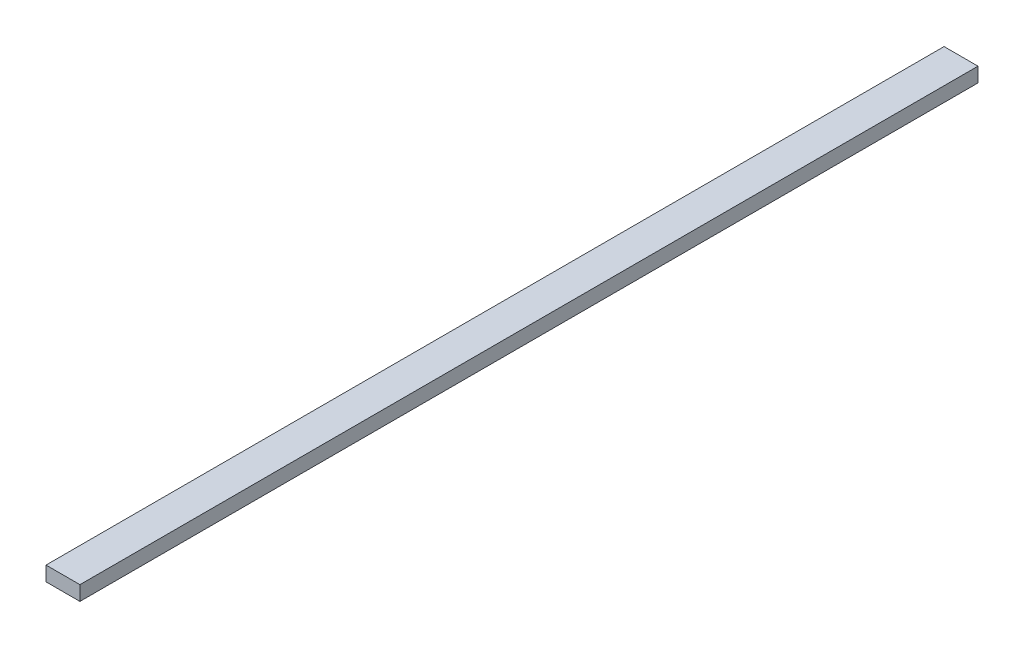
ISO-10303-21;
HEADER;
FILE_DESCRIPTION(('STEP AP214'),'2;1');
FILE_NAME('part.step','',(''),(''),'','','');
FILE_SCHEMA(('AUTOMOTIVE_DESIGN { 1 0 10303 214 1 1 1 1 }'));
ENDSEC;
DATA;
#1=APPLICATION_CONTEXT('core data for automotive mechanical design processes');
#2=APPLICATION_PROTOCOL_DEFINITION('international standard','automotive_design',2000,#1);
#3=PRODUCT_CONTEXT('',#1,'mechanical');
#4=PRODUCT('Part','Part','',(#3));
#5=PRODUCT_RELATED_PRODUCT_CATEGORY('part','',(#4));
#6=PRODUCT_DEFINITION_FORMATION('','',#4);
#7=PRODUCT_DEFINITION_CONTEXT('part definition',#1,'design');
#8=PRODUCT_DEFINITION('design','',#6,#7);
#9=PRODUCT_DEFINITION_SHAPE('','',#8);
#10=(LENGTH_UNIT() NAMED_UNIT(*) SI_UNIT(.MILLI.,.METRE.));
#11=(NAMED_UNIT(*) PLANE_ANGLE_UNIT() SI_UNIT($,.RADIAN.));
#12=(NAMED_UNIT(*) SI_UNIT($,.STERADIAN.) SOLID_ANGLE_UNIT());
#13=UNCERTAINTY_MEASURE_WITH_UNIT(LENGTH_MEASURE(1.E-05),#10,'distance_accuracy_value','');
#14=(GEOMETRIC_REPRESENTATION_CONTEXT(3) GLOBAL_UNCERTAINTY_ASSIGNED_CONTEXT((#13)) GLOBAL_UNIT_ASSIGNED_CONTEXT((#10,
#11,#12)) REPRESENTATION_CONTEXT('',''));
#15=CARTESIAN_POINT('',(0.,0.,0.));
#16=DIRECTION('',(0.,0.,1.));
#17=DIRECTION('',(1.,0.,0.));
#18=AXIS2_PLACEMENT_3D('',#15,#16,#17);
#19=CARTESIAN_POINT('',(-88.9,38.1,0.));
#20=DIRECTION('',(0.,0.,1.));
#21=DIRECTION('',(1.,0.,0.));
#22=AXIS2_PLACEMENT_3D('',#19,#20,#21);
#23=PLANE('',#22);
#24=DIRECTION('',(-1.,0.,0.));
#25=VECTOR('',#24,1.);
#26=CARTESIAN_POINT('',(-88.9,0.,0.));
#27=LINE('',#26,#25);
#28=CARTESIAN_POINT('',(0.,0.,0.));
#29=VERTEX_POINT('',#28);
#30=CARTESIAN_POINT('',(-88.9,0.,0.));
#31=VERTEX_POINT('',#30);
#32=EDGE_CURVE('E96',#29,#31,#27,.T.);
#33=ORIENTED_EDGE('',*,*,#32,.T.);
#34=DIRECTION('',(0.,-1.,0.));
#35=VECTOR('',#34,1.);
#36=CARTESIAN_POINT('',(-88.9,38.1,0.));
#37=LINE('',#36,#35);
#38=CARTESIAN_POINT('',(-88.9,38.1,0.));
#39=VERTEX_POINT('',#38);
#40=EDGE_CURVE('E11',#39,#31,#37,.T.);
#41=ORIENTED_EDGE('',*,*,#40,.F.);
#42=DIRECTION('',(-1.,0.,0.));
#43=VECTOR('',#42,1.);
#44=CARTESIAN_POINT('',(-88.9,38.1,0.));
#45=LINE('',#44,#43);
#46=CARTESIAN_POINT('',(0.,38.1,0.));
#47=VERTEX_POINT('',#46);
#48=EDGE_CURVE('E84',#47,#39,#45,.T.);
#49=ORIENTED_EDGE('',*,*,#48,.F.);
#50=DIRECTION('',(0.,-1.,0.));
#51=VECTOR('',#50,1.);
#52=CARTESIAN_POINT('',(0.,38.1,0.));
#53=LINE('',#52,#51);
#54=EDGE_CURVE('E92',#47,#29,#53,.T.);
#55=ORIENTED_EDGE('',*,*,#54,.T.);
#56=EDGE_LOOP('',(#33,#41,#49,#55));
#57=FACE_BOUND('',#56,.T.);
#58=ADVANCED_FACE('F33',(#57),#23,.F.);
#59=CARTESIAN_POINT('',(-88.9,38.1,2352.675));
#60=DIRECTION('',(1.,0.,0.));
#61=DIRECTION('',(0.,0.,-1.));
#62=AXIS2_PLACEMENT_3D('',#59,#60,#61);
#63=PLANE('',#62);
#64=DIRECTION('',(0.,0.,1.));
#65=VECTOR('',#64,1.);
#66=CARTESIAN_POINT('',(-88.9,0.,2352.675));
#67=LINE('',#66,#65);
#68=CARTESIAN_POINT('',(-88.9,0.,2352.675));
#69=VERTEX_POINT('',#68);
#70=EDGE_CURVE('E88',#31,#69,#67,.T.);
#71=ORIENTED_EDGE('',*,*,#70,.T.);
#72=DIRECTION('',(0.,-1.,0.));
#73=VECTOR('',#72,1.);
#74=CARTESIAN_POINT('',(-88.9,38.1,2352.675));
#75=LINE('',#74,#73);
#76=CARTESIAN_POINT('',(-88.9,38.1,2352.675));
#77=VERTEX_POINT('',#76);
#78=EDGE_CURVE('E41',#77,#69,#75,.T.);
#79=ORIENTED_EDGE('',*,*,#78,.F.);
#80=DIRECTION('',(0.,0.,1.));
#81=VECTOR('',#80,1.);
#82=CARTESIAN_POINT('',(-88.9,38.1,2352.675));
#83=LINE('',#82,#81);
#84=EDGE_CURVE('E79',#39,#77,#83,.T.);
#85=ORIENTED_EDGE('',*,*,#84,.F.);
#86=ORIENTED_EDGE('',*,*,#40,.T.);
#87=EDGE_LOOP('',(#71,#79,#85,#86));
#88=FACE_BOUND('',#87,.T.);
#89=ADVANCED_FACE('F87',(#88),#63,.F.);
#90=CARTESIAN_POINT('',(2.881195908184E-13,38.1,2352.675));
#91=DIRECTION('',(0.,0.,-1.));
#92=DIRECTION('',(-1.,0.,0.));
#93=AXIS2_PLACEMENT_3D('',#90,#91,#92);
#94=PLANE('',#93);
#95=DIRECTION('',(1.,0.,0.));
#96=VECTOR('',#95,1.);
#97=CARTESIAN_POINT('',(2.881195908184E-13,0.,2352.675));
#98=LINE('',#97,#96);
#99=CARTESIAN_POINT('',(2.881195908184E-13,0.,2352.675));
#100=VERTEX_POINT('',#99);
#101=EDGE_CURVE('E66',#69,#100,#98,.T.);
#102=ORIENTED_EDGE('',*,*,#101,.T.);
#103=DIRECTION('',(0.,-1.,0.));
#104=VECTOR('',#103,1.);
#105=CARTESIAN_POINT('',(2.881195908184E-13,38.1,2352.675));
#106=LINE('',#105,#104);
#107=CARTESIAN_POINT('',(2.881195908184E-13,38.1,2352.675));
#108=VERTEX_POINT('',#107);
#109=EDGE_CURVE('E89',#108,#100,#106,.T.);
#110=ORIENTED_EDGE('',*,*,#109,.F.);
#111=DIRECTION('',(1.,0.,0.));
#112=VECTOR('',#111,1.);
#113=CARTESIAN_POINT('',(2.881195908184E-13,38.1,2352.675));
#114=LINE('',#113,#112);
#115=EDGE_CURVE('E82',#77,#108,#114,.T.);
#116=ORIENTED_EDGE('',*,*,#115,.F.);
#117=ORIENTED_EDGE('',*,*,#78,.T.);
#118=EDGE_LOOP('',(#102,#110,#116,#117));
#119=FACE_BOUND('',#118,.T.);
#120=ADVANCED_FACE('F90',(#119),#94,.F.);
#121=CARTESIAN_POINT('',(0.,38.1,0.));
#122=DIRECTION('',(-1.,0.,0.));
#123=DIRECTION('',(0.,0.,1.));
#124=AXIS2_PLACEMENT_3D('',#121,#122,#123);
#125=PLANE('',#124);
#126=DIRECTION('',(0.,0.,-1.));
#127=VECTOR('',#126,1.);
#128=CARTESIAN_POINT('',(0.,0.,0.));
#129=LINE('',#128,#127);
#130=EDGE_CURVE('E72',#100,#29,#129,.T.);
#131=ORIENTED_EDGE('',*,*,#130,.T.);
#132=ORIENTED_EDGE('',*,*,#54,.F.);
#133=DIRECTION('',(0.,0.,-1.));
#134=VECTOR('',#133,1.);
#135=CARTESIAN_POINT('',(0.,38.1,0.));
#136=LINE('',#135,#134);
#137=EDGE_CURVE('E49',#108,#47,#136,.T.);
#138=ORIENTED_EDGE('',*,*,#137,.F.);
#139=ORIENTED_EDGE('',*,*,#109,.T.);
#140=EDGE_LOOP('',(#131,#132,#138,#139));
#141=FACE_BOUND('',#140,.T.);
#142=ADVANCED_FACE('F103',(#141),#125,.F.);
#143=CARTESIAN_POINT('',(0.,38.1,0.));
#144=DIRECTION('',(0.,-1.,0.));
#145=DIRECTION('',(0.,0.,-1.));
#146=AXIS2_PLACEMENT_3D('',#143,#144,#145);
#147=PLANE('',#146);
#148=ORIENTED_EDGE('',*,*,#48,.T.);
#149=ORIENTED_EDGE('',*,*,#84,.T.);
#150=ORIENTED_EDGE('',*,*,#115,.T.);
#151=ORIENTED_EDGE('',*,*,#137,.T.);
#152=EDGE_LOOP('',(#148,#149,#150,#151));
#153=FACE_BOUND('',#152,.T.);
#154=ADVANCED_FACE('F80',(#153),#147,.F.);
#155=CARTESIAN_POINT('',(0.,0.,0.));
#156=DIRECTION('',(0.,-1.,0.));
#157=DIRECTION('',(0.,0.,-1.));
#158=AXIS2_PLACEMENT_3D('',#155,#156,#157);
#159=PLANE('',#158);
#160=ORIENTED_EDGE('',*,*,#32,.F.);
#161=ORIENTED_EDGE('',*,*,#130,.F.);
#162=ORIENTED_EDGE('',*,*,#101,.F.);
#163=ORIENTED_EDGE('',*,*,#70,.F.);
#164=EDGE_LOOP('',(#160,#161,#162,#163));
#165=FACE_BOUND('',#164,.T.);
#166=ADVANCED_FACE('F106',(#165),#159,.T.);
#167=CLOSED_SHELL('',(#58,#89,#120,#142,#154,#166));
#168=MANIFOLD_SOLID_BREP('B2',#167);
#169=ADVANCED_BREP_SHAPE_REPRESENTATION('',(#18,#168),#14);
#170=SHAPE_DEFINITION_REPRESENTATION(#9,#169);
ENDSEC;
END-ISO-10303-21;
